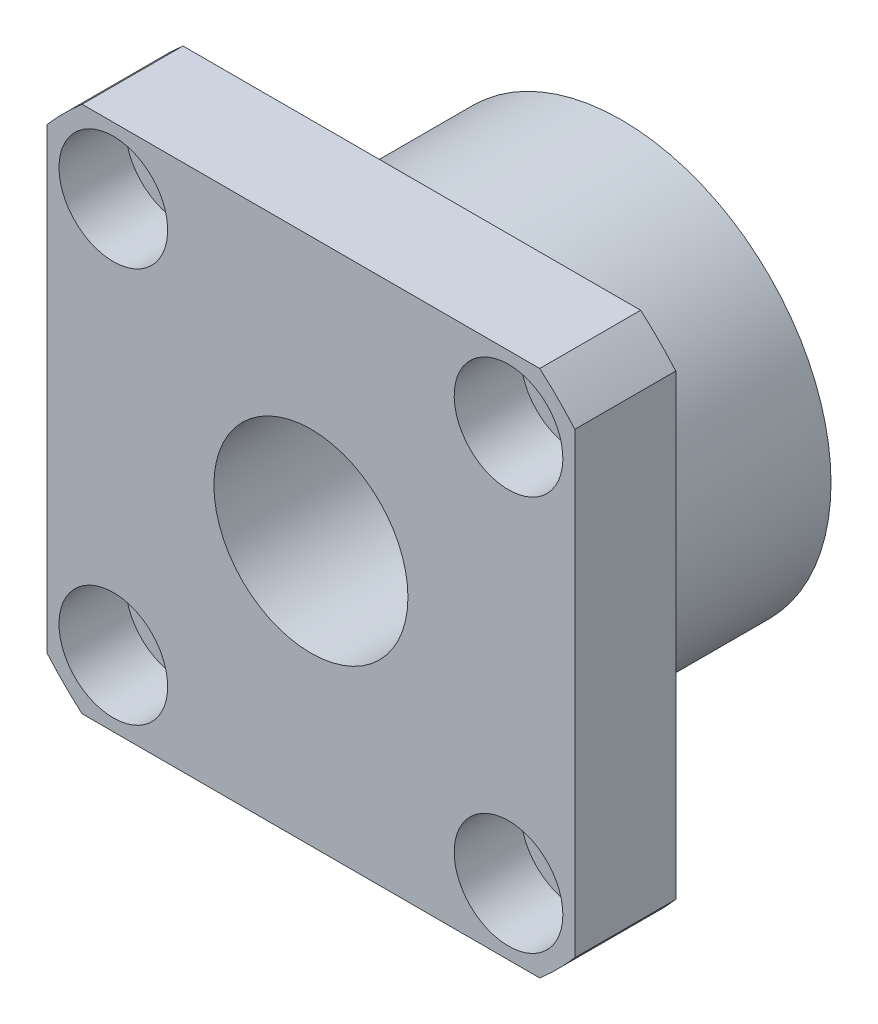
ISO-10303-21;
HEADER;
FILE_DESCRIPTION(('STEP AP214'),'2;1');
FILE_NAME('part.step','',(''),(''),'','','');
FILE_SCHEMA(('AUTOMOTIVE_DESIGN { 1 0 10303 214 1 1 1 1 }'));
ENDSEC;
DATA;
#1=APPLICATION_CONTEXT('core data for automotive mechanical design processes');
#2=APPLICATION_PROTOCOL_DEFINITION('international standard','automotive_design',2000,#1);
#3=PRODUCT_CONTEXT('',#1,'mechanical');
#4=PRODUCT('Part','Part','',(#3));
#5=PRODUCT_RELATED_PRODUCT_CATEGORY('part','',(#4));
#6=PRODUCT_DEFINITION_FORMATION('','',#4);
#7=PRODUCT_DEFINITION_CONTEXT('part definition',#1,'design');
#8=PRODUCT_DEFINITION('design','',#6,#7);
#9=PRODUCT_DEFINITION_SHAPE('','',#8);
#10=(LENGTH_UNIT() NAMED_UNIT(*) SI_UNIT(.MILLI.,.METRE.));
#11=(NAMED_UNIT(*) PLANE_ANGLE_UNIT() SI_UNIT($,.RADIAN.));
#12=(NAMED_UNIT(*) SI_UNIT($,.STERADIAN.) SOLID_ANGLE_UNIT());
#13=UNCERTAINTY_MEASURE_WITH_UNIT(LENGTH_MEASURE(1.E-05),#10,'distance_accuracy_value','');
#14=(GEOMETRIC_REPRESENTATION_CONTEXT(3) GLOBAL_UNCERTAINTY_ASSIGNED_CONTEXT((#13)) GLOBAL_UNIT_ASSIGNED_CONTEXT((#10,
#11,#12)) REPRESENTATION_CONTEXT('',''));
#15=CARTESIAN_POINT('',(0.,0.,0.));
#16=DIRECTION('',(0.,0.,1.));
#17=DIRECTION('',(1.,0.,0.));
#18=AXIS2_PLACEMENT_3D('',#15,#16,#17);
#19=CARTESIAN_POINT('',(0.,0.,0.));
#20=DIRECTION('',(0.,0.,-1.));
#21=DIRECTION('',(-1.,0.,0.));
#22=AXIS2_PLACEMENT_3D('',#19,#20,#21);
#23=PLANE('',#22);
#24=CARTESIAN_POINT('',(-25.4558441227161,-25.4558441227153,0.));
#25=DIRECTION('',(0.,0.,-1.));
#26=DIRECTION('',(0.,-1.,0.));
#27=AXIS2_PLACEMENT_3D('',#24,#25,#26);
#28=CIRCLE('',#27,5.);
#29=CARTESIAN_POINT('',(-25.4558441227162,-30.4558441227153,0.));
#30=VERTEX_POINT('',#29);
#31=EDGE_CURVE('E156',#30,#30,#28,.T.);
#32=ORIENTED_EDGE('',*,*,#31,.F.);
#33=EDGE_LOOP('',(#32));
#34=FACE_BOUND('',#33,.T.);
#35=CARTESIAN_POINT('',(25.455844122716,25.4558441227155,0.));
#36=DIRECTION('',(0.,0.,-1.));
#37=DIRECTION('',(0.,1.,0.));
#38=AXIS2_PLACEMENT_3D('',#35,#36,#37);
#39=CIRCLE('',#38,5.);
#40=CARTESIAN_POINT('',(25.455844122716,30.4558441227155,0.));
#41=VERTEX_POINT('',#40);
#42=EDGE_CURVE('E190',#41,#41,#39,.T.);
#43=ORIENTED_EDGE('',*,*,#42,.F.);
#44=EDGE_LOOP('',(#43));
#45=FACE_BOUND('',#44,.T.);
#46=CARTESIAN_POINT('',(0.,0.,0.));
#47=DIRECTION('',(0.,0.,-1.));
#48=DIRECTION('',(-1.,0.,0.));
#49=AXIS2_PLACEMENT_3D('',#46,#47,#48);
#50=CIRCLE('',#49,45.);
#51=CARTESIAN_POINT('',(34.,-29.4788059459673,0.));
#52=VERTEX_POINT('',#51);
#53=CARTESIAN_POINT('',(29.4788059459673,-34.,0.));
#54=VERTEX_POINT('',#53);
#55=EDGE_CURVE('E80',#52,#54,#50,.T.);
#56=ORIENTED_EDGE('',*,*,#55,.T.);
#57=DIRECTION('',(1.,0.,0.));
#58=VECTOR('',#57,1.);
#59=CARTESIAN_POINT('',(-29.4788059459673,-34.,0.));
#60=LINE('',#59,#58);
#61=CARTESIAN_POINT('',(-29.4788059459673,-34.,0.));
#62=VERTEX_POINT('',#61);
#63=EDGE_CURVE('E94',#62,#54,#60,.T.);
#64=ORIENTED_EDGE('',*,*,#63,.F.);
#65=CARTESIAN_POINT('',(0.,0.,0.));
#66=DIRECTION('',(0.,0.,1.));
#67=DIRECTION('',(1.,0.,0.));
#68=AXIS2_PLACEMENT_3D('',#65,#66,#67);
#69=CIRCLE('',#68,45.);
#70=CARTESIAN_POINT('',(-34.,-29.4788059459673,0.));
#71=VERTEX_POINT('',#70);
#72=EDGE_CURVE('E101',#71,#62,#69,.T.);
#73=ORIENTED_EDGE('',*,*,#72,.F.);
#74=DIRECTION('',(0.,-1.,0.));
#75=VECTOR('',#74,1.);
#76=CARTESIAN_POINT('',(-34.,29.4788059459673,0.));
#77=LINE('',#76,#75);
#78=CARTESIAN_POINT('',(-34.,29.4788059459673,0.));
#79=VERTEX_POINT('',#78);
#80=EDGE_CURVE('E103',#79,#71,#77,.T.);
#81=ORIENTED_EDGE('',*,*,#80,.F.);
#82=CARTESIAN_POINT('',(0.,0.,0.));
#83=DIRECTION('',(0.,0.,-1.));
#84=DIRECTION('',(-1.,0.,0.));
#85=AXIS2_PLACEMENT_3D('',#82,#83,#84);
#86=CIRCLE('',#85,45.);
#87=CARTESIAN_POINT('',(-29.4788059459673,34.,0.));
#88=VERTEX_POINT('',#87);
#89=EDGE_CURVE('E109',#79,#88,#86,.T.);
#90=ORIENTED_EDGE('',*,*,#89,.T.);
#91=DIRECTION('',(1.,0.,0.));
#92=VECTOR('',#91,1.);
#93=CARTESIAN_POINT('',(-29.4788059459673,34.,0.));
#94=LINE('',#93,#92);
#95=CARTESIAN_POINT('',(29.4788059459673,34.,0.));
#96=VERTEX_POINT('',#95);
#97=EDGE_CURVE('E112',#88,#96,#94,.T.);
#98=ORIENTED_EDGE('',*,*,#97,.T.);
#99=CARTESIAN_POINT('',(0.,0.,0.));
#100=DIRECTION('',(0.,0.,1.));
#101=DIRECTION('',(1.,0.,0.));
#102=AXIS2_PLACEMENT_3D('',#99,#100,#101);
#103=CIRCLE('',#102,45.);
#104=CARTESIAN_POINT('',(34.,29.4788059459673,0.));
#105=VERTEX_POINT('',#104);
#106=EDGE_CURVE('E115',#105,#96,#103,.T.);
#107=ORIENTED_EDGE('',*,*,#106,.F.);
#108=DIRECTION('',(0.,-1.,0.));
#109=VECTOR('',#108,1.);
#110=CARTESIAN_POINT('',(34.,29.4788059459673,0.));
#111=LINE('',#110,#109);
#112=EDGE_CURVE('E97',#105,#52,#111,.T.);
#113=ORIENTED_EDGE('',*,*,#112,.T.);
#114=EDGE_LOOP('',(#56,#64,#73,#81,#90,#98,#107,#113));
#115=FACE_BOUND('',#114,.T.);
#116=CARTESIAN_POINT('',(-25.4558441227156,25.4558441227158,0.));
#117=DIRECTION('',(0.,0.,-1.));
#118=DIRECTION('',(-1.,0.,0.));
#119=AXIS2_PLACEMENT_3D('',#116,#117,#118);
#120=CIRCLE('',#119,5.);
#121=CARTESIAN_POINT('',(-30.4558441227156,25.4558441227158,0.));
#122=VERTEX_POINT('',#121);
#123=EDGE_CURVE('E151',#122,#122,#120,.T.);
#124=ORIENTED_EDGE('',*,*,#123,.F.);
#125=EDGE_LOOP('',(#124));
#126=FACE_BOUND('',#125,.T.);
#127=CARTESIAN_POINT('',(25.4558441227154,-25.455844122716,0.));
#128=DIRECTION('',(0.,0.,-1.));
#129=DIRECTION('',(1.,0.,0.));
#130=AXIS2_PLACEMENT_3D('',#127,#128,#129);
#131=CIRCLE('',#130,5.);
#132=CARTESIAN_POINT('',(30.4558441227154,-25.455844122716,0.));
#133=VERTEX_POINT('',#132);
#134=EDGE_CURVE('E187',#133,#133,#131,.T.);
#135=ORIENTED_EDGE('',*,*,#134,.F.);
#136=EDGE_LOOP('',(#135));
#137=FACE_BOUND('',#136,.T.);
#138=CARTESIAN_POINT('',(0.,0.,0.));
#139=DIRECTION('',(0.,0.,-1.));
#140=DIRECTION('',(-1.,0.,0.));
#141=AXIS2_PLACEMENT_3D('',#138,#139,#140);
#142=CIRCLE('',#141,27.);
#143=CARTESIAN_POINT('',(-27.,0.,0.));
#144=VERTEX_POINT('',#143);
#145=EDGE_CURVE('E18',#144,#144,#142,.F.);
#146=ORIENTED_EDGE('',*,*,#145,.T.);
#147=EDGE_LOOP('',(#146));
#148=FACE_BOUND('',#147,.T.);
#149=ADVANCED_FACE('F14',(#34,#45,#115,#126,#137,#148),#23,.T.);
#150=CARTESIAN_POINT('',(0.,0.,13.));
#151=DIRECTION('',(0.,0.,-1.));
#152=DIRECTION('',(-1.,0.,0.));
#153=AXIS2_PLACEMENT_3D('',#150,#151,#152);
#154=PLANE('',#153);
#155=CARTESIAN_POINT('',(0.,0.,13.));
#156=DIRECTION('',(0.,0.,1.));
#157=DIRECTION('',(1.,0.,0.));
#158=AXIS2_PLACEMENT_3D('',#155,#156,#157);
#159=CIRCLE('',#158,12.5);
#160=CARTESIAN_POINT('',(12.5,0.,13.));
#161=VERTEX_POINT('',#160);
#162=EDGE_CURVE('E98',#161,#161,#159,.T.);
#163=ORIENTED_EDGE('',*,*,#162,.F.);
#164=EDGE_LOOP('',(#163));
#165=FACE_BOUND('',#164,.T.);
#166=CARTESIAN_POINT('',(-25.4558441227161,-25.4558441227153,13.));
#167=DIRECTION('',(0.,0.,-1.));
#168=DIRECTION('',(0.,-1.,0.));
#169=AXIS2_PLACEMENT_3D('',#166,#167,#168);
#170=CIRCLE('',#169,7.);
#171=CARTESIAN_POINT('',(-25.4558441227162,-32.4558441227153,13.));
#172=VERTEX_POINT('',#171);
#173=EDGE_CURVE('E171',#172,#172,#170,.T.);
#174=ORIENTED_EDGE('',*,*,#173,.T.);
#175=EDGE_LOOP('',(#174));
#176=FACE_BOUND('',#175,.T.);
#177=CARTESIAN_POINT('',(25.455844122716,25.4558441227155,13.));
#178=DIRECTION('',(0.,0.,-1.));
#179=DIRECTION('',(0.,1.,0.));
#180=AXIS2_PLACEMENT_3D('',#177,#178,#179);
#181=CIRCLE('',#180,7.);
#182=CARTESIAN_POINT('',(25.455844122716,32.4558441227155,13.));
#183=VERTEX_POINT('',#182);
#184=EDGE_CURVE('E160',#183,#183,#181,.T.);
#185=ORIENTED_EDGE('',*,*,#184,.T.);
#186=EDGE_LOOP('',(#185));
#187=FACE_BOUND('',#186,.T.);
#188=CARTESIAN_POINT('',(-25.4558441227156,25.4558441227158,13.));
#189=DIRECTION('',(0.,0.,-1.));
#190=DIRECTION('',(-1.,0.,0.));
#191=AXIS2_PLACEMENT_3D('',#188,#189,#190);
#192=CIRCLE('',#191,7.);
#193=CARTESIAN_POINT('',(-32.4558441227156,25.4558441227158,13.));
#194=VERTEX_POINT('',#193);
#195=EDGE_CURVE('E193',#194,#194,#192,.T.);
#196=ORIENTED_EDGE('',*,*,#195,.T.);
#197=EDGE_LOOP('',(#196));
#198=FACE_BOUND('',#197,.T.);
#199=CARTESIAN_POINT('',(0.,0.,13.));
#200=DIRECTION('',(0.,0.,-1.));
#201=DIRECTION('',(-1.,0.,0.));
#202=AXIS2_PLACEMENT_3D('',#199,#200,#201);
#203=CIRCLE('',#202,45.);
#204=CARTESIAN_POINT('',(34.,-29.4788059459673,13.));
#205=VERTEX_POINT('',#204);
#206=CARTESIAN_POINT('',(29.4788059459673,-34.,13.));
#207=VERTEX_POINT('',#206);
#208=EDGE_CURVE('E82',#205,#207,#203,.T.);
#209=ORIENTED_EDGE('',*,*,#208,.F.);
#210=DIRECTION('',(0.,-1.,0.));
#211=VECTOR('',#210,1.);
#212=CARTESIAN_POINT('',(34.,29.4788059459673,13.));
#213=LINE('',#212,#211);
#214=CARTESIAN_POINT('',(34.,29.4788059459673,13.));
#215=VERTEX_POINT('',#214);
#216=EDGE_CURVE('E88',#215,#205,#213,.T.);
#217=ORIENTED_EDGE('',*,*,#216,.F.);
#218=CARTESIAN_POINT('',(0.,0.,13.));
#219=DIRECTION('',(0.,0.,1.));
#220=DIRECTION('',(1.,0.,0.));
#221=AXIS2_PLACEMENT_3D('',#218,#219,#220);
#222=CIRCLE('',#221,45.);
#223=CARTESIAN_POINT('',(29.4788059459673,34.,13.));
#224=VERTEX_POINT('',#223);
#225=EDGE_CURVE('E134',#215,#224,#222,.T.);
#226=ORIENTED_EDGE('',*,*,#225,.T.);
#227=DIRECTION('',(1.,0.,0.));
#228=VECTOR('',#227,1.);
#229=CARTESIAN_POINT('',(-29.4788059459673,34.,13.));
#230=LINE('',#229,#228);
#231=CARTESIAN_POINT('',(-29.4788059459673,34.,13.));
#232=VERTEX_POINT('',#231);
#233=EDGE_CURVE('E131',#232,#224,#230,.T.);
#234=ORIENTED_EDGE('',*,*,#233,.F.);
#235=CARTESIAN_POINT('',(0.,0.,13.));
#236=DIRECTION('',(0.,0.,-1.));
#237=DIRECTION('',(-1.,0.,0.));
#238=AXIS2_PLACEMENT_3D('',#235,#236,#237);
#239=CIRCLE('',#238,45.);
#240=CARTESIAN_POINT('',(-34.,29.4788059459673,13.));
#241=VERTEX_POINT('',#240);
#242=EDGE_CURVE('E128',#241,#232,#239,.T.);
#243=ORIENTED_EDGE('',*,*,#242,.F.);
#244=DIRECTION('',(0.,-1.,0.));
#245=VECTOR('',#244,1.);
#246=CARTESIAN_POINT('',(-34.,29.4788059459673,13.));
#247=LINE('',#246,#245);
#248=CARTESIAN_POINT('',(-34.,-29.4788059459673,13.));
#249=VERTEX_POINT('',#248);
#250=EDGE_CURVE('E125',#241,#249,#247,.T.);
#251=ORIENTED_EDGE('',*,*,#250,.T.);
#252=CARTESIAN_POINT('',(0.,0.,13.));
#253=DIRECTION('',(0.,0.,1.));
#254=DIRECTION('',(1.,0.,0.));
#255=AXIS2_PLACEMENT_3D('',#252,#253,#254);
#256=CIRCLE('',#255,45.);
#257=CARTESIAN_POINT('',(-29.4788059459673,-34.,13.));
#258=VERTEX_POINT('',#257);
#259=EDGE_CURVE('E122',#249,#258,#256,.T.);
#260=ORIENTED_EDGE('',*,*,#259,.T.);
#261=DIRECTION('',(1.,0.,0.));
#262=VECTOR('',#261,1.);
#263=CARTESIAN_POINT('',(-29.4788059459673,-34.,13.));
#264=LINE('',#263,#262);
#265=EDGE_CURVE('E120',#258,#207,#264,.T.);
#266=ORIENTED_EDGE('',*,*,#265,.T.);
#267=EDGE_LOOP('',(#209,#217,#226,#234,#243,#251,#260,#266));
#268=FACE_BOUND('',#267,.T.);
#269=CARTESIAN_POINT('',(25.4558441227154,-25.455844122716,13.));
#270=DIRECTION('',(0.,0.,-1.));
#271=DIRECTION('',(1.,0.,0.));
#272=AXIS2_PLACEMENT_3D('',#269,#270,#271);
#273=CIRCLE('',#272,7.);
#274=CARTESIAN_POINT('',(32.4558441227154,-25.455844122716,13.));
#275=VERTEX_POINT('',#274);
#276=EDGE_CURVE('E164',#275,#275,#273,.T.);
#277=ORIENTED_EDGE('',*,*,#276,.T.);
#278=EDGE_LOOP('',(#277));
#279=FACE_BOUND('',#278,.T.);
#280=ADVANCED_FACE('F205',(#165,#176,#187,#198,#268,#279),#154,.F.);
#281=CARTESIAN_POINT('',(0.,0.,13.));
#282=DIRECTION('',(0.,0.,-1.));
#283=DIRECTION('',(-1.,0.,0.));
#284=AXIS2_PLACEMENT_3D('',#281,#282,#283);
#285=CYLINDRICAL_SURFACE('',#284,45.);
#286=DIRECTION('',(0.,0.,-1.));
#287=VECTOR('',#286,1.);
#288=CARTESIAN_POINT('',(34.,-29.4788059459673,13.));
#289=LINE('',#288,#287);
#290=EDGE_CURVE('E9',#205,#52,#289,.T.);
#291=ORIENTED_EDGE('',*,*,#290,.F.);
#292=ORIENTED_EDGE('',*,*,#208,.T.);
#293=DIRECTION('',(0.,0.,-1.));
#294=VECTOR('',#293,1.);
#295=CARTESIAN_POINT('',(29.4788059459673,-34.,13.));
#296=LINE('',#295,#294);
#297=EDGE_CURVE('E77',#207,#54,#296,.T.);
#298=ORIENTED_EDGE('',*,*,#297,.T.);
#299=ORIENTED_EDGE('',*,*,#55,.F.);
#300=EDGE_LOOP('',(#291,#292,#298,#299));
#301=FACE_BOUND('',#300,.T.);
#302=ADVANCED_FACE('F79',(#301),#285,.T.);
#303=CARTESIAN_POINT('',(34.,29.4788059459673,13.));
#304=DIRECTION('',(1.,0.,0.));
#305=DIRECTION('',(0.,0.,-1.));
#306=AXIS2_PLACEMENT_3D('',#303,#304,#305);
#307=PLANE('',#306);
#308=DIRECTION('',(0.,0.,-1.));
#309=VECTOR('',#308,1.);
#310=CARTESIAN_POINT('',(34.,29.4788059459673,13.));
#311=LINE('',#310,#309);
#312=EDGE_CURVE('E23',#215,#105,#311,.T.);
#313=ORIENTED_EDGE('',*,*,#312,.F.);
#314=ORIENTED_EDGE('',*,*,#216,.T.);
#315=ORIENTED_EDGE('',*,*,#290,.T.);
#316=ORIENTED_EDGE('',*,*,#112,.F.);
#317=EDGE_LOOP('',(#313,#314,#315,#316));
#318=FACE_BOUND('',#317,.T.);
#319=ADVANCED_FACE('F16',(#318),#307,.T.);
#320=CARTESIAN_POINT('',(0.,0.,13.));
#321=DIRECTION('',(0.,0.,-1.));
#322=DIRECTION('',(-1.,0.,0.));
#323=AXIS2_PLACEMENT_3D('',#320,#321,#322);
#324=CYLINDRICAL_SURFACE('',#323,45.);
#325=DIRECTION('',(0.,0.,-1.));
#326=VECTOR('',#325,1.);
#327=CARTESIAN_POINT('',(29.4788059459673,34.,13.));
#328=LINE('',#327,#326);
#329=EDGE_CURVE('E145',#224,#96,#328,.T.);
#330=ORIENTED_EDGE('',*,*,#329,.F.);
#331=ORIENTED_EDGE('',*,*,#225,.F.);
#332=ORIENTED_EDGE('',*,*,#312,.T.);
#333=ORIENTED_EDGE('',*,*,#106,.T.);
#334=EDGE_LOOP('',(#330,#331,#332,#333));
#335=FACE_BOUND('',#334,.T.);
#336=ADVANCED_FACE('F269',(#335),#324,.T.);
#337=CARTESIAN_POINT('',(-29.4788059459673,34.,13.));
#338=DIRECTION('',(0.,1.,0.));
#339=DIRECTION('',(0.,0.,1.));
#340=AXIS2_PLACEMENT_3D('',#337,#338,#339);
#341=PLANE('',#340);
#342=DIRECTION('',(0.,0.,-1.));
#343=VECTOR('',#342,1.);
#344=CARTESIAN_POINT('',(-29.4788059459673,34.,13.));
#345=LINE('',#344,#343);
#346=EDGE_CURVE('E143',#232,#88,#345,.T.);
#347=ORIENTED_EDGE('',*,*,#346,.F.);
#348=ORIENTED_EDGE('',*,*,#233,.T.);
#349=ORIENTED_EDGE('',*,*,#329,.T.);
#350=ORIENTED_EDGE('',*,*,#97,.F.);
#351=EDGE_LOOP('',(#347,#348,#349,#350));
#352=FACE_BOUND('',#351,.T.);
#353=ADVANCED_FACE('F266',(#352),#341,.T.);
#354=CARTESIAN_POINT('',(0.,0.,13.));
#355=DIRECTION('',(0.,0.,-1.));
#356=DIRECTION('',(-1.,0.,0.));
#357=AXIS2_PLACEMENT_3D('',#354,#355,#356);
#358=CYLINDRICAL_SURFACE('',#357,45.);
#359=DIRECTION('',(0.,0.,-1.));
#360=VECTOR('',#359,1.);
#361=CARTESIAN_POINT('',(-34.,29.4788059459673,13.));
#362=LINE('',#361,#360);
#363=EDGE_CURVE('E141',#241,#79,#362,.T.);
#364=ORIENTED_EDGE('',*,*,#363,.F.);
#365=ORIENTED_EDGE('',*,*,#242,.T.);
#366=ORIENTED_EDGE('',*,*,#346,.T.);
#367=ORIENTED_EDGE('',*,*,#89,.F.);
#368=EDGE_LOOP('',(#364,#365,#366,#367));
#369=FACE_BOUND('',#368,.T.);
#370=ADVANCED_FACE('F262',(#369),#358,.T.);
#371=CARTESIAN_POINT('',(-34.,29.4788059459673,13.));
#372=DIRECTION('',(1.,0.,0.));
#373=DIRECTION('',(0.,0.,-1.));
#374=AXIS2_PLACEMENT_3D('',#371,#372,#373);
#375=PLANE('',#374);
#376=DIRECTION('',(0.,0.,-1.));
#377=VECTOR('',#376,1.);
#378=CARTESIAN_POINT('',(-34.,-29.4788059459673,13.));
#379=LINE('',#378,#377);
#380=EDGE_CURVE('E139',#249,#71,#379,.T.);
#381=ORIENTED_EDGE('',*,*,#380,.F.);
#382=ORIENTED_EDGE('',*,*,#250,.F.);
#383=ORIENTED_EDGE('',*,*,#363,.T.);
#384=ORIENTED_EDGE('',*,*,#80,.T.);
#385=EDGE_LOOP('',(#381,#382,#383,#384));
#386=FACE_BOUND('',#385,.T.);
#387=ADVANCED_FACE('F258',(#386),#375,.F.);
#388=CARTESIAN_POINT('',(0.,0.,13.));
#389=DIRECTION('',(0.,0.,-1.));
#390=DIRECTION('',(-1.,0.,0.));
#391=AXIS2_PLACEMENT_3D('',#388,#389,#390);
#392=CYLINDRICAL_SURFACE('',#391,45.);
#393=DIRECTION('',(0.,0.,-1.));
#394=VECTOR('',#393,1.);
#395=CARTESIAN_POINT('',(-29.4788059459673,-34.,13.));
#396=LINE('',#395,#394);
#397=EDGE_CURVE('E87',#258,#62,#396,.T.);
#398=ORIENTED_EDGE('',*,*,#397,.F.);
#399=ORIENTED_EDGE('',*,*,#259,.F.);
#400=ORIENTED_EDGE('',*,*,#380,.T.);
#401=ORIENTED_EDGE('',*,*,#72,.T.);
#402=EDGE_LOOP('',(#398,#399,#400,#401));
#403=FACE_BOUND('',#402,.T.);
#404=ADVANCED_FACE('F255',(#403),#392,.T.);
#405=CARTESIAN_POINT('',(-29.4788059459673,-34.,13.));
#406=DIRECTION('',(0.,1.,0.));
#407=DIRECTION('',(0.,0.,1.));
#408=AXIS2_PLACEMENT_3D('',#405,#406,#407);
#409=PLANE('',#408);
#410=ORIENTED_EDGE('',*,*,#265,.F.);
#411=ORIENTED_EDGE('',*,*,#397,.T.);
#412=ORIENTED_EDGE('',*,*,#63,.T.);
#413=ORIENTED_EDGE('',*,*,#297,.F.);
#414=EDGE_LOOP('',(#410,#411,#412,#413));
#415=FACE_BOUND('',#414,.T.);
#416=ADVANCED_FACE('F100',(#415),#409,.F.);
#417=CARTESIAN_POINT('',(0.,0.,13.));
#418=DIRECTION('',(0.,0.,-1.));
#419=DIRECTION('',(-1.,0.,0.));
#420=AXIS2_PLACEMENT_3D('',#417,#418,#419);
#421=CYLINDRICAL_SURFACE('',#420,12.5);
#422=ORIENTED_EDGE('',*,*,#162,.T.);
#423=EDGE_LOOP('',(#422));
#424=FACE_BOUND('',#423,.T.);
#425=CARTESIAN_POINT('',(0.,0.,-27.));
#426=DIRECTION('',(0.,0.,-1.));
#427=DIRECTION('',(-1.,0.,0.));
#428=AXIS2_PLACEMENT_3D('',#425,#426,#427);
#429=CIRCLE('',#428,12.5);
#430=CARTESIAN_POINT('',(-12.5,0.,-27.));
#431=VERTEX_POINT('',#430);
#432=EDGE_CURVE('E475',#431,#431,#429,.T.);
#433=ORIENTED_EDGE('',*,*,#432,.T.);
#434=EDGE_LOOP('',(#433));
#435=FACE_BOUND('',#434,.T.);
#436=ADVANCED_FACE('F202',(#424,#435),#421,.F.);
#437=CARTESIAN_POINT('',(-25.4558441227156,25.4558441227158,0.));
#438=DIRECTION('',(0.,0.,1.));
#439=DIRECTION('',(1.,0.,0.));
#440=AXIS2_PLACEMENT_3D('',#437,#438,#439);
#441=CYLINDRICAL_SURFACE('',#440,5.);
#442=CARTESIAN_POINT('',(-25.4558441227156,25.4558441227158,4.4));
#443=DIRECTION('',(0.,0.,-1.));
#444=DIRECTION('',(-1.,0.,0.));
#445=AXIS2_PLACEMENT_3D('',#442,#443,#444);
#446=CIRCLE('',#445,5.);
#447=CARTESIAN_POINT('',(-30.4558441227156,25.4558441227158,4.4));
#448=VERTEX_POINT('',#447);
#449=EDGE_CURVE('E148',#448,#448,#446,.T.);
#450=ORIENTED_EDGE('',*,*,#449,.F.);
#451=EDGE_LOOP('',(#450));
#452=FACE_BOUND('',#451,.T.);
#453=ORIENTED_EDGE('',*,*,#123,.T.);
#454=EDGE_LOOP('',(#453));
#455=FACE_BOUND('',#454,.T.);
#456=ADVANCED_FACE('F351',(#452,#455),#441,.F.);
#457=CARTESIAN_POINT('',(-25.4558441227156,25.4558441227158,4.4));
#458=DIRECTION('',(0.,0.,1.));
#459=DIRECTION('',(1.,0.,0.));
#460=AXIS2_PLACEMENT_3D('',#457,#458,#459);
#461=CYLINDRICAL_SURFACE('',#460,7.);
#462=CARTESIAN_POINT('',(-25.4558441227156,25.4558441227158,4.4));
#463=DIRECTION('',(0.,0.,-1.));
#464=DIRECTION('',(-1.,0.,0.));
#465=AXIS2_PLACEMENT_3D('',#462,#463,#464);
#466=CIRCLE('',#465,7.);
#467=CARTESIAN_POINT('',(-32.4558441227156,25.4558441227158,4.4));
#468=VERTEX_POINT('',#467);
#469=EDGE_CURVE('E152',#468,#468,#466,.T.);
#470=ORIENTED_EDGE('',*,*,#469,.T.);
#471=EDGE_LOOP('',(#470));
#472=FACE_BOUND('',#471,.T.);
#473=ORIENTED_EDGE('',*,*,#195,.F.);
#474=EDGE_LOOP('',(#473));
#475=FACE_BOUND('',#474,.T.);
#476=ADVANCED_FACE('F358',(#472,#475),#461,.F.);
#477=CARTESIAN_POINT('',(-25.4558441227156,25.4558441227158,4.4));
#478=DIRECTION('',(0.,0.,-1.));
#479=DIRECTION('',(-1.,0.,0.));
#480=AXIS2_PLACEMENT_3D('',#477,#478,#479);
#481=PLANE('',#480);
#482=ORIENTED_EDGE('',*,*,#449,.T.);
#483=EDGE_LOOP('',(#482));
#484=FACE_BOUND('',#483,.T.);
#485=ORIENTED_EDGE('',*,*,#469,.F.);
#486=EDGE_LOOP('',(#485));
#487=FACE_BOUND('',#486,.T.);
#488=ADVANCED_FACE('F360',(#484,#487),#481,.F.);
#489=CARTESIAN_POINT('',(25.455844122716,25.4558441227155,0.));
#490=DIRECTION('',(0.,0.,1.));
#491=DIRECTION('',(1.,0.,0.));
#492=AXIS2_PLACEMENT_3D('',#489,#490,#491);
#493=CYLINDRICAL_SURFACE('',#492,5.);
#494=CARTESIAN_POINT('',(25.455844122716,25.4558441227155,4.4));
#495=DIRECTION('',(0.,0.,-1.));
#496=DIRECTION('',(-1.,0.,0.));
#497=AXIS2_PLACEMENT_3D('',#494,#495,#496);
#498=CIRCLE('',#497,5.);
#499=CARTESIAN_POINT('',(20.4558441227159,25.4558441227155,4.4));
#500=VERTEX_POINT('',#499);
#501=EDGE_CURVE('E153',#500,#500,#498,.T.);
#502=ORIENTED_EDGE('',*,*,#501,.F.);
#503=EDGE_LOOP('',(#502));
#504=FACE_BOUND('',#503,.T.);
#505=ORIENTED_EDGE('',*,*,#42,.T.);
#506=EDGE_LOOP('',(#505));
#507=FACE_BOUND('',#506,.T.);
#508=ADVANCED_FACE('F369',(#504,#507),#493,.F.);
#509=CARTESIAN_POINT('',(25.4558441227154,-25.455844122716,0.));
#510=DIRECTION('',(0.,0.,1.));
#511=DIRECTION('',(1.,0.,0.));
#512=AXIS2_PLACEMENT_3D('',#509,#510,#511);
#513=CYLINDRICAL_SURFACE('',#512,5.);
#514=CARTESIAN_POINT('',(25.4558441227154,-25.455844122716,4.4));
#515=DIRECTION('',(0.,0.,-1.));
#516=DIRECTION('',(-1.,0.,0.));
#517=AXIS2_PLACEMENT_3D('',#514,#515,#516);
#518=CIRCLE('',#517,5.);
#519=CARTESIAN_POINT('',(20.4558441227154,-25.455844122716,4.4));
#520=VERTEX_POINT('',#519);
#521=EDGE_CURVE('E158',#520,#520,#518,.T.);
#522=ORIENTED_EDGE('',*,*,#521,.F.);
#523=EDGE_LOOP('',(#522));
#524=FACE_BOUND('',#523,.T.);
#525=ORIENTED_EDGE('',*,*,#134,.T.);
#526=EDGE_LOOP('',(#525));
#527=FACE_BOUND('',#526,.T.);
#528=ADVANCED_FACE('F384',(#524,#527),#513,.F.);
#529=CARTESIAN_POINT('',(-25.4558441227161,-25.4558441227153,0.));
#530=DIRECTION('',(0.,0.,1.));
#531=DIRECTION('',(1.,0.,0.));
#532=AXIS2_PLACEMENT_3D('',#529,#530,#531);
#533=CYLINDRICAL_SURFACE('',#532,5.);
#534=CARTESIAN_POINT('',(-25.4558441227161,-25.4558441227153,4.4));
#535=DIRECTION('',(0.,0.,-1.));
#536=DIRECTION('',(-1.,0.,0.));
#537=AXIS2_PLACEMENT_3D('',#534,#535,#536);
#538=CIRCLE('',#537,5.);
#539=CARTESIAN_POINT('',(-30.4558441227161,-25.4558441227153,4.4));
#540=VERTEX_POINT('',#539);
#541=EDGE_CURVE('E162',#540,#540,#538,.T.);
#542=ORIENTED_EDGE('',*,*,#541,.F.);
#543=EDGE_LOOP('',(#542));
#544=FACE_BOUND('',#543,.T.);
#545=ORIENTED_EDGE('',*,*,#31,.T.);
#546=EDGE_LOOP('',(#545));
#547=FACE_BOUND('',#546,.T.);
#548=ADVANCED_FACE('F237',(#544,#547),#533,.F.);
#549=CARTESIAN_POINT('',(25.455844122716,25.4558441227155,4.4));
#550=DIRECTION('',(0.,0.,1.));
#551=DIRECTION('',(1.,0.,0.));
#552=AXIS2_PLACEMENT_3D('',#549,#550,#551);
#553=CYLINDRICAL_SURFACE('',#552,7.);
#554=CARTESIAN_POINT('',(25.455844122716,25.4558441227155,4.4));
#555=DIRECTION('',(0.,0.,-1.));
#556=DIRECTION('',(0.,1.,0.));
#557=AXIS2_PLACEMENT_3D('',#554,#555,#556);
#558=CIRCLE('',#557,7.);
#559=CARTESIAN_POINT('',(25.455844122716,32.4558441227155,4.4));
#560=VERTEX_POINT('',#559);
#561=EDGE_CURVE('E157',#560,#560,#558,.T.);
#562=ORIENTED_EDGE('',*,*,#561,.T.);
#563=EDGE_LOOP('',(#562));
#564=FACE_BOUND('',#563,.T.);
#565=ORIENTED_EDGE('',*,*,#184,.F.);
#566=EDGE_LOOP('',(#565));
#567=FACE_BOUND('',#566,.T.);
#568=ADVANCED_FACE('F234',(#564,#567),#553,.F.);
#569=CARTESIAN_POINT('',(25.455844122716,25.4558441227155,4.4));
#570=DIRECTION('',(0.,0.,-1.));
#571=DIRECTION('',(0.,1.,0.));
#572=AXIS2_PLACEMENT_3D('',#569,#570,#571);
#573=PLANE('',#572);
#574=ORIENTED_EDGE('',*,*,#501,.T.);
#575=EDGE_LOOP('',(#574));
#576=FACE_BOUND('',#575,.T.);
#577=ORIENTED_EDGE('',*,*,#561,.F.);
#578=EDGE_LOOP('',(#577));
#579=FACE_BOUND('',#578,.T.);
#580=ADVANCED_FACE('F222',(#576,#579),#573,.F.);
#581=CARTESIAN_POINT('',(25.4558441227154,-25.455844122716,4.4));
#582=DIRECTION('',(0.,0.,1.));
#583=DIRECTION('',(1.,0.,0.));
#584=AXIS2_PLACEMENT_3D('',#581,#582,#583);
#585=CYLINDRICAL_SURFACE('',#584,7.);
#586=CARTESIAN_POINT('',(25.4558441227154,-25.455844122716,4.4));
#587=DIRECTION('',(0.,0.,-1.));
#588=DIRECTION('',(1.,0.,0.));
#589=AXIS2_PLACEMENT_3D('',#586,#587,#588);
#590=CIRCLE('',#589,7.);
#591=CARTESIAN_POINT('',(32.4558441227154,-25.455844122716,4.4));
#592=VERTEX_POINT('',#591);
#593=EDGE_CURVE('E161',#592,#592,#590,.T.);
#594=ORIENTED_EDGE('',*,*,#593,.T.);
#595=EDGE_LOOP('',(#594));
#596=FACE_BOUND('',#595,.T.);
#597=ORIENTED_EDGE('',*,*,#276,.F.);
#598=EDGE_LOOP('',(#597));
#599=FACE_BOUND('',#598,.T.);
#600=ADVANCED_FACE('F219',(#596,#599),#585,.F.);
#601=CARTESIAN_POINT('',(25.4558441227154,-25.455844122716,4.4));
#602=DIRECTION('',(0.,0.,-1.));
#603=DIRECTION('',(1.,0.,0.));
#604=AXIS2_PLACEMENT_3D('',#601,#602,#603);
#605=PLANE('',#604);
#606=ORIENTED_EDGE('',*,*,#521,.T.);
#607=EDGE_LOOP('',(#606));
#608=FACE_BOUND('',#607,.T.);
#609=ORIENTED_EDGE('',*,*,#593,.F.);
#610=EDGE_LOOP('',(#609));
#611=FACE_BOUND('',#610,.T.);
#612=ADVANCED_FACE('F221',(#608,#611),#605,.F.);
#613=CARTESIAN_POINT('',(-25.4558441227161,-25.4558441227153,4.4));
#614=DIRECTION('',(0.,0.,1.));
#615=DIRECTION('',(1.,0.,0.));
#616=AXIS2_PLACEMENT_3D('',#613,#614,#615);
#617=CYLINDRICAL_SURFACE('',#616,7.);
#618=CARTESIAN_POINT('',(-25.4558441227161,-25.4558441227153,4.4));
#619=DIRECTION('',(0.,0.,-1.));
#620=DIRECTION('',(0.,-1.,0.));
#621=AXIS2_PLACEMENT_3D('',#618,#619,#620);
#622=CIRCLE('',#621,7.);
#623=CARTESIAN_POINT('',(-25.4558441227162,-32.4558441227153,4.4));
#624=VERTEX_POINT('',#623);
#625=EDGE_CURVE('E165',#624,#624,#622,.T.);
#626=ORIENTED_EDGE('',*,*,#625,.T.);
#627=EDGE_LOOP('',(#626));
#628=FACE_BOUND('',#627,.T.);
#629=ORIENTED_EDGE('',*,*,#173,.F.);
#630=EDGE_LOOP('',(#629));
#631=FACE_BOUND('',#630,.T.);
#632=ADVANCED_FACE('F231',(#628,#631),#617,.F.);
#633=CARTESIAN_POINT('',(-25.4558441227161,-25.4558441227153,4.4));
#634=DIRECTION('',(0.,0.,-1.));
#635=DIRECTION('',(0.,-1.,0.));
#636=AXIS2_PLACEMENT_3D('',#633,#634,#635);
#637=PLANE('',#636);
#638=ORIENTED_EDGE('',*,*,#541,.T.);
#639=EDGE_LOOP('',(#638));
#640=FACE_BOUND('',#639,.T.);
#641=ORIENTED_EDGE('',*,*,#625,.F.);
#642=EDGE_LOOP('',(#641));
#643=FACE_BOUND('',#642,.T.);
#644=ADVANCED_FACE('F225',(#640,#643),#637,.F.);
#645=CARTESIAN_POINT('',(0.,0.,-27.));
#646=DIRECTION('',(0.,0.,-1.));
#647=DIRECTION('',(-1.,0.,0.));
#648=AXIS2_PLACEMENT_3D('',#645,#646,#647);
#649=PLANE('',#648);
#650=CARTESIAN_POINT('',(0.,0.,-27.));
#651=DIRECTION('',(0.,0.,-1.));
#652=DIRECTION('',(-1.,0.,0.));
#653=AXIS2_PLACEMENT_3D('',#650,#651,#652);
#654=CIRCLE('',#653,27.);
#655=CARTESIAN_POINT('',(-27.,0.,-27.));
#656=VERTEX_POINT('',#655);
#657=EDGE_CURVE('E474',#656,#656,#654,.T.);
#658=ORIENTED_EDGE('',*,*,#657,.T.);
#659=EDGE_LOOP('',(#658));
#660=FACE_BOUND('',#659,.T.);
#661=ORIENTED_EDGE('',*,*,#432,.F.);
#662=EDGE_LOOP('',(#661));
#663=FACE_BOUND('',#662,.T.);
#664=ADVANCED_FACE('F239',(#660,#663),#649,.T.);
#665=CARTESIAN_POINT('',(0.,0.,-27.));
#666=DIRECTION('',(0.,0.,1.));
#667=DIRECTION('',(1.,0.,0.));
#668=AXIS2_PLACEMENT_3D('',#665,#666,#667);
#669=CYLINDRICAL_SURFACE('',#668,27.);
#670=ORIENTED_EDGE('',*,*,#145,.F.);
#671=EDGE_LOOP('',(#670));
#672=FACE_BOUND('',#671,.T.);
#673=ORIENTED_EDGE('',*,*,#657,.F.);
#674=EDGE_LOOP('',(#673));
#675=FACE_BOUND('',#674,.T.);
#676=ADVANCED_FACE('F426',(#672,#675),#669,.T.);
#677=CLOSED_SHELL('',(#149,#280,#302,#319,#336,#353,#370,#387,#404,#416,#436,#456,#476,#488,
#508,#528,#548,#568,#580,#600,#612,#632,#644,#664,#676));
#678=MANIFOLD_SOLID_BREP('B1',#677);
#679=ADVANCED_BREP_SHAPE_REPRESENTATION('',(#18,#678),#14);
#680=SHAPE_DEFINITION_REPRESENTATION(#9,#679);
ENDSEC;
END-ISO-10303-21;
